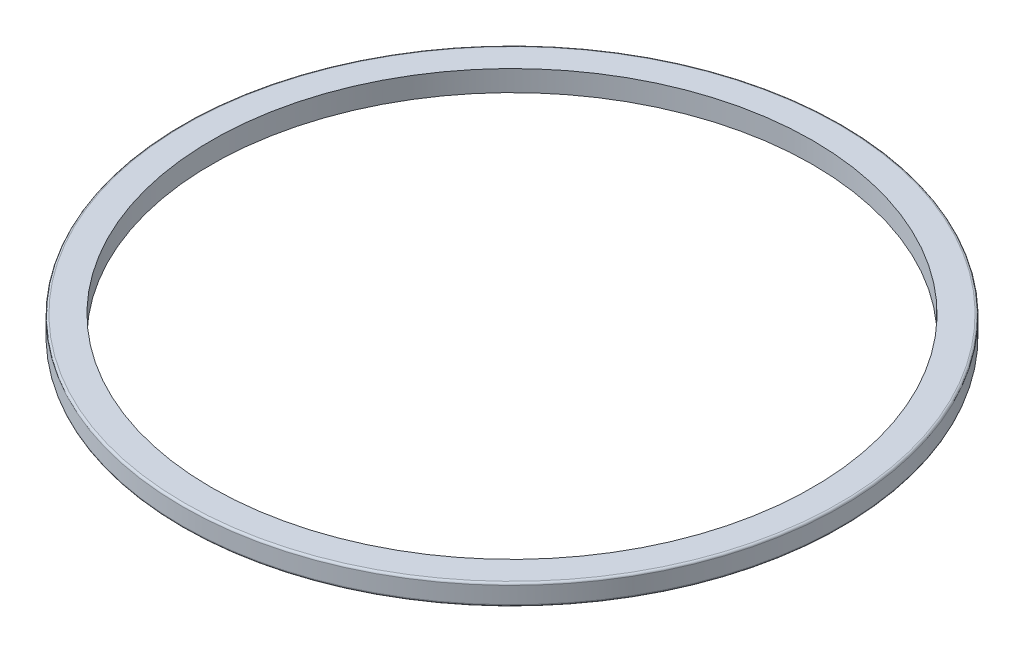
ISO-10303-21;
HEADER;
FILE_DESCRIPTION(('STEP AP214'),'2;1');
FILE_NAME('part.step','',(''),(''),'','','');
FILE_SCHEMA(('AUTOMOTIVE_DESIGN { 1 0 10303 214 1 1 1 1 }'));
ENDSEC;
DATA;
#1=APPLICATION_CONTEXT('core data for automotive mechanical design processes');
#2=APPLICATION_PROTOCOL_DEFINITION('international standard','automotive_design',2000,#1);
#3=PRODUCT_CONTEXT('',#1,'mechanical');
#4=PRODUCT('Part','Part','',(#3));
#5=PRODUCT_RELATED_PRODUCT_CATEGORY('part','',(#4));
#6=PRODUCT_DEFINITION_FORMATION('','',#4);
#7=PRODUCT_DEFINITION_CONTEXT('part definition',#1,'design');
#8=PRODUCT_DEFINITION('design','',#6,#7);
#9=PRODUCT_DEFINITION_SHAPE('','',#8);
#10=(LENGTH_UNIT() NAMED_UNIT(*) SI_UNIT(.MILLI.,.METRE.));
#11=(NAMED_UNIT(*) PLANE_ANGLE_UNIT() SI_UNIT($,.RADIAN.));
#12=(NAMED_UNIT(*) SI_UNIT($,.STERADIAN.) SOLID_ANGLE_UNIT());
#13=UNCERTAINTY_MEASURE_WITH_UNIT(LENGTH_MEASURE(1.E-05),#10,'distance_accuracy_value','');
#14=(GEOMETRIC_REPRESENTATION_CONTEXT(3) GLOBAL_UNCERTAINTY_ASSIGNED_CONTEXT((#13)) GLOBAL_UNIT_ASSIGNED_CONTEXT((#10,
#11,#12)) REPRESENTATION_CONTEXT('',''));
#15=CARTESIAN_POINT('',(0.,0.,0.));
#16=DIRECTION('',(0.,0.,1.));
#17=DIRECTION('',(1.,0.,0.));
#18=AXIS2_PLACEMENT_3D('',#15,#16,#17);
#19=CARTESIAN_POINT('',(0.,6.35,0.));
#20=DIRECTION('',(0.,1.,0.));
#21=DIRECTION('',(0.,0.,1.));
#22=AXIS2_PLACEMENT_3D('',#19,#20,#21);
#23=PLANE('',#22);
#24=CARTESIAN_POINT('',(0.,6.35,0.));
#25=DIRECTION('',(0.,1.,0.));
#26=DIRECTION('',(0.,0.,1.));
#27=AXIS2_PLACEMENT_3D('',#24,#25,#26);
#28=CIRCLE('',#27,99.695);
#29=CARTESIAN_POINT('',(0.,6.35,99.695));
#30=VERTEX_POINT('',#29);
#31=EDGE_CURVE('E10',#30,#30,#28,.T.);
#32=ORIENTED_EDGE('',*,*,#31,.T.);
#33=EDGE_LOOP('',(#32));
#34=FACE_BOUND('',#33,.T.);
#35=CARTESIAN_POINT('',(0.,6.35,0.));
#36=DIRECTION('',(0.,1.,0.));
#37=DIRECTION('',(0.,0.,1.));
#38=AXIS2_PLACEMENT_3D('',#35,#36,#37);
#39=CIRCLE('',#38,91.51112);
#40=CARTESIAN_POINT('',(0.,6.35,91.51112));
#41=VERTEX_POINT('',#40);
#42=EDGE_CURVE('E51',#41,#41,#39,.T.);
#43=ORIENTED_EDGE('',*,*,#42,.F.);
#44=EDGE_LOOP('',(#43));
#45=FACE_BOUND('',#44,.T.);
#46=ADVANCED_FACE('F31',(#34,#45),#23,.T.);
#47=CARTESIAN_POINT('',(0.,0.,0.));
#48=DIRECTION('',(0.,1.,0.));
#49=DIRECTION('',(0.,0.,1.));
#50=AXIS2_PLACEMENT_3D('',#47,#48,#49);
#51=PLANE('',#50);
#52=CARTESIAN_POINT('',(0.,0.,0.));
#53=DIRECTION('',(0.,1.,0.));
#54=DIRECTION('',(0.,0.,1.));
#55=AXIS2_PLACEMENT_3D('',#52,#53,#54);
#56=CIRCLE('',#55,99.695);
#57=CARTESIAN_POINT('',(0.,0.,99.695));
#58=VERTEX_POINT('',#57);
#59=EDGE_CURVE('E38',#58,#58,#56,.F.);
#60=ORIENTED_EDGE('',*,*,#59,.T.);
#61=EDGE_LOOP('',(#60));
#62=FACE_BOUND('',#61,.T.);
#63=CARTESIAN_POINT('',(0.,0.,0.));
#64=DIRECTION('',(0.,1.,0.));
#65=DIRECTION('',(0.,0.,1.));
#66=AXIS2_PLACEMENT_3D('',#63,#64,#65);
#67=CIRCLE('',#66,91.51112);
#68=CARTESIAN_POINT('',(0.,0.,91.51112));
#69=VERTEX_POINT('',#68);
#70=EDGE_CURVE('E52',#69,#69,#67,.T.);
#71=ORIENTED_EDGE('',*,*,#70,.T.);
#72=EDGE_LOOP('',(#71));
#73=FACE_BOUND('',#72,.T.);
#74=ADVANCED_FACE('F62',(#62,#73),#51,.F.);
#75=CARTESIAN_POINT('',(0.,6.35,0.));
#76=DIRECTION('',(0.,-1.,0.));
#77=DIRECTION('',(0.,0.,-1.));
#78=AXIS2_PLACEMENT_3D('',#75,#76,#77);
#79=CYLINDRICAL_SURFACE('',#78,100.33);
#80=CARTESIAN_POINT('',(0.,0.635,0.));
#81=DIRECTION('',(0.,1.,0.));
#82=DIRECTION('',(0.,0.,1.));
#83=AXIS2_PLACEMENT_3D('',#80,#81,#82);
#84=CIRCLE('',#83,100.33);
#85=CARTESIAN_POINT('',(0.,0.635,100.33));
#86=VERTEX_POINT('',#85);
#87=EDGE_CURVE('E42',#86,#86,#84,.T.);
#88=ORIENTED_EDGE('',*,*,#87,.T.);
#89=EDGE_LOOP('',(#88));
#90=FACE_BOUND('',#89,.T.);
#91=CARTESIAN_POINT('',(0.,5.715,0.));
#92=DIRECTION('',(0.,1.,0.));
#93=DIRECTION('',(0.,0.,1.));
#94=AXIS2_PLACEMENT_3D('',#91,#92,#93);
#95=CIRCLE('',#94,100.33);
#96=CARTESIAN_POINT('',(0.,5.715,100.33));
#97=VERTEX_POINT('',#96);
#98=EDGE_CURVE('E46',#97,#97,#95,.F.);
#99=ORIENTED_EDGE('',*,*,#98,.T.);
#100=EDGE_LOOP('',(#99));
#101=FACE_BOUND('',#100,.T.);
#102=ADVANCED_FACE('F67',(#90,#101),#79,.T.);
#103=CARTESIAN_POINT('',(0.,6.35,0.));
#104=DIRECTION('',(0.,-1.,0.));
#105=DIRECTION('',(0.,0.,-1.));
#106=AXIS2_PLACEMENT_3D('',#103,#104,#105);
#107=CYLINDRICAL_SURFACE('',#106,91.51112);
#108=ORIENTED_EDGE('',*,*,#42,.T.);
#109=EDGE_LOOP('',(#108));
#110=FACE_BOUND('',#109,.T.);
#111=ORIENTED_EDGE('',*,*,#70,.F.);
#112=EDGE_LOOP('',(#111));
#113=FACE_BOUND('',#112,.T.);
#114=ADVANCED_FACE('F58',(#110,#113),#107,.F.);
#115=CARTESIAN_POINT('',(0.,0.635,0.));
#116=DIRECTION('',(0.,1.,0.));
#117=DIRECTION('',(0.,0.,1.));
#118=AXIS2_PLACEMENT_3D('',#115,#116,#117);
#119=TOROIDAL_SURFACE('',#118,99.695,0.635);
#120=ORIENTED_EDGE('',*,*,#59,.F.);
#121=EDGE_LOOP('',(#120));
#122=FACE_BOUND('',#121,.T.);
#123=ORIENTED_EDGE('',*,*,#87,.F.);
#124=EDGE_LOOP('',(#123));
#125=FACE_BOUND('',#124,.T.);
#126=ADVANCED_FACE('F73',(#122,#125),#119,.T.);
#127=CARTESIAN_POINT('',(0.,5.715,0.));
#128=DIRECTION('',(0.,1.,0.));
#129=DIRECTION('',(0.,0.,1.));
#130=AXIS2_PLACEMENT_3D('',#127,#128,#129);
#131=TOROIDAL_SURFACE('',#130,99.695,0.635);
#132=ORIENTED_EDGE('',*,*,#98,.F.);
#133=EDGE_LOOP('',(#132));
#134=FACE_BOUND('',#133,.T.);
#135=ORIENTED_EDGE('',*,*,#31,.F.);
#136=EDGE_LOOP('',(#135));
#137=FACE_BOUND('',#136,.T.);
#138=ADVANCED_FACE('F33',(#134,#137),#131,.T.);
#139=CLOSED_SHELL('',(#46,#74,#102,#114,#126,#138));
#140=MANIFOLD_SOLID_BREP('B2',#139);
#141=ADVANCED_BREP_SHAPE_REPRESENTATION('',(#18,#140),#14);
#142=SHAPE_DEFINITION_REPRESENTATION(#9,#141);
ENDSEC;
END-ISO-10303-21;
